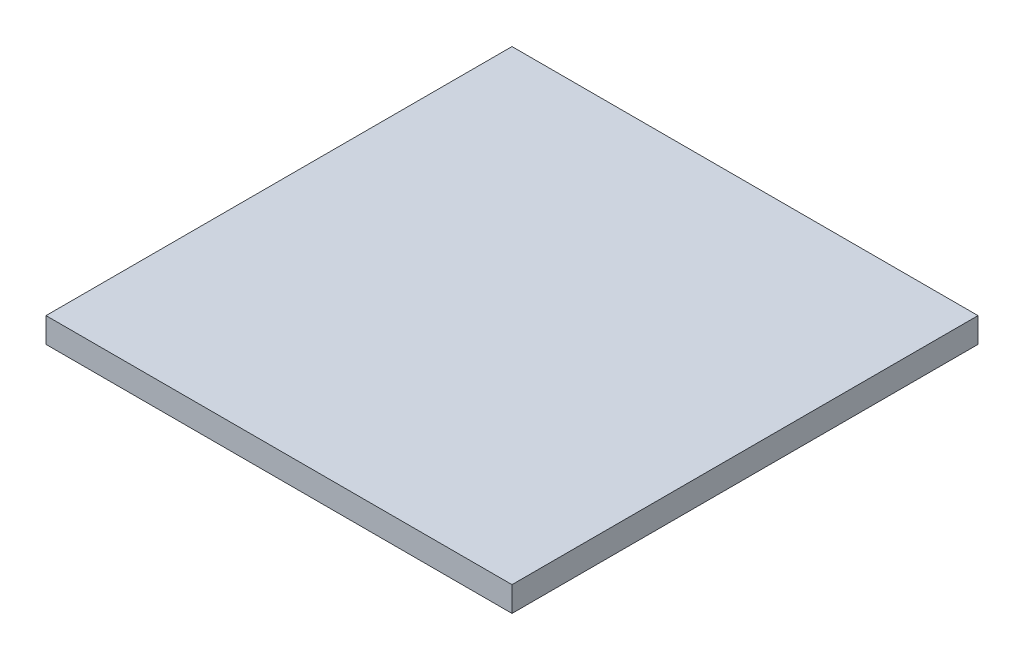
ISO-10303-21;
HEADER;
FILE_DESCRIPTION(('STEP AP214'),'2;1');
FILE_NAME('part.step','',(''),(''),'','','');
FILE_SCHEMA(('AUTOMOTIVE_DESIGN { 1 0 10303 214 1 1 1 1 }'));
ENDSEC;
DATA;
#1=APPLICATION_CONTEXT('core data for automotive mechanical design processes');
#2=APPLICATION_PROTOCOL_DEFINITION('international standard','automotive_design',2000,#1);
#3=PRODUCT_CONTEXT('',#1,'mechanical');
#4=PRODUCT('Part','Part','',(#3));
#5=PRODUCT_RELATED_PRODUCT_CATEGORY('part','',(#4));
#6=PRODUCT_DEFINITION_FORMATION('','',#4);
#7=PRODUCT_DEFINITION_CONTEXT('part definition',#1,'design');
#8=PRODUCT_DEFINITION('design','',#6,#7);
#9=PRODUCT_DEFINITION_SHAPE('','',#8);
#10=(LENGTH_UNIT() NAMED_UNIT(*) SI_UNIT(.MILLI.,.METRE.));
#11=(NAMED_UNIT(*) PLANE_ANGLE_UNIT() SI_UNIT($,.RADIAN.));
#12=(NAMED_UNIT(*) SI_UNIT($,.STERADIAN.) SOLID_ANGLE_UNIT());
#13=UNCERTAINTY_MEASURE_WITH_UNIT(LENGTH_MEASURE(1.E-05),#10,'distance_accuracy_value','');
#14=(GEOMETRIC_REPRESENTATION_CONTEXT(3) GLOBAL_UNCERTAINTY_ASSIGNED_CONTEXT((#13)) GLOBAL_UNIT_ASSIGNED_CONTEXT((#10,
#11,#12)) REPRESENTATION_CONTEXT('',''));
#15=CARTESIAN_POINT('',(0.,0.,0.));
#16=DIRECTION('',(0.,0.,1.));
#17=DIRECTION('',(1.,0.,0.));
#18=AXIS2_PLACEMENT_3D('',#15,#16,#17);
#19=CARTESIAN_POINT('',(0.,4.7625,0.));
#20=DIRECTION('',(1.,0.,0.));
#21=DIRECTION('',(0.,0.,-1.));
#22=AXIS2_PLACEMENT_3D('',#19,#20,#21);
#23=PLANE('',#22);
#24=DIRECTION('',(0.,0.,1.));
#25=VECTOR('',#24,1.);
#26=CARTESIAN_POINT('',(0.,0.,0.));
#27=LINE('',#26,#25);
#28=CARTESIAN_POINT('',(0.,0.,-88.9));
#29=VERTEX_POINT('',#28);
#30=CARTESIAN_POINT('',(0.,0.,0.));
#31=VERTEX_POINT('',#30);
#32=EDGE_CURVE('E96',#29,#31,#27,.T.);
#33=ORIENTED_EDGE('',*,*,#32,.T.);
#34=DIRECTION('',(0.,-1.,0.));
#35=VECTOR('',#34,1.);
#36=CARTESIAN_POINT('',(0.,4.7625,0.));
#37=LINE('',#36,#35);
#38=CARTESIAN_POINT('',(0.,4.7625,0.));
#39=VERTEX_POINT('',#38);
#40=EDGE_CURVE('E11',#39,#31,#37,.T.);
#41=ORIENTED_EDGE('',*,*,#40,.F.);
#42=DIRECTION('',(0.,0.,1.));
#43=VECTOR('',#42,1.);
#44=CARTESIAN_POINT('',(0.,4.7625,0.));
#45=LINE('',#44,#43);
#46=CARTESIAN_POINT('',(0.,4.7625,-88.9));
#47=VERTEX_POINT('',#46);
#48=EDGE_CURVE('E84',#47,#39,#45,.T.);
#49=ORIENTED_EDGE('',*,*,#48,.F.);
#50=DIRECTION('',(0.,-1.,0.));
#51=VECTOR('',#50,1.);
#52=CARTESIAN_POINT('',(0.,4.7625,-88.9));
#53=LINE('',#52,#51);
#54=EDGE_CURVE('E92',#47,#29,#53,.T.);
#55=ORIENTED_EDGE('',*,*,#54,.T.);
#56=EDGE_LOOP('',(#33,#41,#49,#55));
#57=FACE_BOUND('',#56,.T.);
#58=ADVANCED_FACE('F33',(#57),#23,.F.);
#59=CARTESIAN_POINT('',(0.,4.7625,0.));
#60=DIRECTION('',(0.,0.,-1.));
#61=DIRECTION('',(-1.,0.,0.));
#62=AXIS2_PLACEMENT_3D('',#59,#60,#61);
#63=PLANE('',#62);
#64=DIRECTION('',(1.,0.,0.));
#65=VECTOR('',#64,1.);
#66=CARTESIAN_POINT('',(0.,0.,0.));
#67=LINE('',#66,#65);
#68=CARTESIAN_POINT('',(88.9,0.,0.));
#69=VERTEX_POINT('',#68);
#70=EDGE_CURVE('E88',#31,#69,#67,.T.);
#71=ORIENTED_EDGE('',*,*,#70,.T.);
#72=DIRECTION('',(0.,-1.,0.));
#73=VECTOR('',#72,1.);
#74=CARTESIAN_POINT('',(88.9,4.7625,0.));
#75=LINE('',#74,#73);
#76=CARTESIAN_POINT('',(88.9,4.7625,0.));
#77=VERTEX_POINT('',#76);
#78=EDGE_CURVE('E41',#77,#69,#75,.T.);
#79=ORIENTED_EDGE('',*,*,#78,.F.);
#80=DIRECTION('',(1.,0.,0.));
#81=VECTOR('',#80,1.);
#82=CARTESIAN_POINT('',(0.,4.7625,0.));
#83=LINE('',#82,#81);
#84=EDGE_CURVE('E79',#39,#77,#83,.T.);
#85=ORIENTED_EDGE('',*,*,#84,.F.);
#86=ORIENTED_EDGE('',*,*,#40,.T.);
#87=EDGE_LOOP('',(#71,#79,#85,#86));
#88=FACE_BOUND('',#87,.T.);
#89=ADVANCED_FACE('F87',(#88),#63,.F.);
#90=CARTESIAN_POINT('',(88.9,4.7625,0.));
#91=DIRECTION('',(-1.,0.,0.));
#92=DIRECTION('',(0.,0.,1.));
#93=AXIS2_PLACEMENT_3D('',#90,#91,#92);
#94=PLANE('',#93);
#95=DIRECTION('',(0.,0.,-1.));
#96=VECTOR('',#95,1.);
#97=CARTESIAN_POINT('',(88.9,0.,0.));
#98=LINE('',#97,#96);
#99=CARTESIAN_POINT('',(88.9,0.,-88.9));
#100=VERTEX_POINT('',#99);
#101=EDGE_CURVE('E66',#69,#100,#98,.T.);
#102=ORIENTED_EDGE('',*,*,#101,.T.);
#103=DIRECTION('',(0.,-1.,0.));
#104=VECTOR('',#103,1.);
#105=CARTESIAN_POINT('',(88.9,4.7625,-88.9));
#106=LINE('',#105,#104);
#107=CARTESIAN_POINT('',(88.9,4.7625,-88.9));
#108=VERTEX_POINT('',#107);
#109=EDGE_CURVE('E89',#108,#100,#106,.T.);
#110=ORIENTED_EDGE('',*,*,#109,.F.);
#111=DIRECTION('',(0.,0.,-1.));
#112=VECTOR('',#111,1.);
#113=CARTESIAN_POINT('',(88.9,4.7625,0.));
#114=LINE('',#113,#112);
#115=EDGE_CURVE('E82',#77,#108,#114,.T.);
#116=ORIENTED_EDGE('',*,*,#115,.F.);
#117=ORIENTED_EDGE('',*,*,#78,.T.);
#118=EDGE_LOOP('',(#102,#110,#116,#117));
#119=FACE_BOUND('',#118,.T.);
#120=ADVANCED_FACE('F90',(#119),#94,.F.);
#121=CARTESIAN_POINT('',(0.,4.7625,-88.9));
#122=DIRECTION('',(0.,0.,1.));
#123=DIRECTION('',(1.,0.,0.));
#124=AXIS2_PLACEMENT_3D('',#121,#122,#123);
#125=PLANE('',#124);
#126=DIRECTION('',(-1.,0.,0.));
#127=VECTOR('',#126,1.);
#128=CARTESIAN_POINT('',(0.,0.,-88.9));
#129=LINE('',#128,#127);
#130=EDGE_CURVE('E72',#100,#29,#129,.T.);
#131=ORIENTED_EDGE('',*,*,#130,.T.);
#132=ORIENTED_EDGE('',*,*,#54,.F.);
#133=DIRECTION('',(-1.,0.,0.));
#134=VECTOR('',#133,1.);
#135=CARTESIAN_POINT('',(0.,4.7625,-88.9));
#136=LINE('',#135,#134);
#137=EDGE_CURVE('E49',#108,#47,#136,.T.);
#138=ORIENTED_EDGE('',*,*,#137,.F.);
#139=ORIENTED_EDGE('',*,*,#109,.T.);
#140=EDGE_LOOP('',(#131,#132,#138,#139));
#141=FACE_BOUND('',#140,.T.);
#142=ADVANCED_FACE('F103',(#141),#125,.F.);
#143=CARTESIAN_POINT('',(0.,4.7625,0.));
#144=DIRECTION('',(0.,-1.,0.));
#145=DIRECTION('',(0.,0.,-1.));
#146=AXIS2_PLACEMENT_3D('',#143,#144,#145);
#147=PLANE('',#146);
#148=ORIENTED_EDGE('',*,*,#48,.T.);
#149=ORIENTED_EDGE('',*,*,#84,.T.);
#150=ORIENTED_EDGE('',*,*,#115,.T.);
#151=ORIENTED_EDGE('',*,*,#137,.T.);
#152=EDGE_LOOP('',(#148,#149,#150,#151));
#153=FACE_BOUND('',#152,.T.);
#154=ADVANCED_FACE('F80',(#153),#147,.F.);
#155=CARTESIAN_POINT('',(0.,0.,0.));
#156=DIRECTION('',(0.,-1.,0.));
#157=DIRECTION('',(0.,0.,-1.));
#158=AXIS2_PLACEMENT_3D('',#155,#156,#157);
#159=PLANE('',#158);
#160=ORIENTED_EDGE('',*,*,#32,.F.);
#161=ORIENTED_EDGE('',*,*,#130,.F.);
#162=ORIENTED_EDGE('',*,*,#101,.F.);
#163=ORIENTED_EDGE('',*,*,#70,.F.);
#164=EDGE_LOOP('',(#160,#161,#162,#163));
#165=FACE_BOUND('',#164,.T.);
#166=ADVANCED_FACE('F106',(#165),#159,.T.);
#167=CLOSED_SHELL('',(#58,#89,#120,#142,#154,#166));
#168=MANIFOLD_SOLID_BREP('B2',#167);
#169=ADVANCED_BREP_SHAPE_REPRESENTATION('',(#18,#168),#14);
#170=SHAPE_DEFINITION_REPRESENTATION(#9,#169);
ENDSEC;
END-ISO-10303-21;
